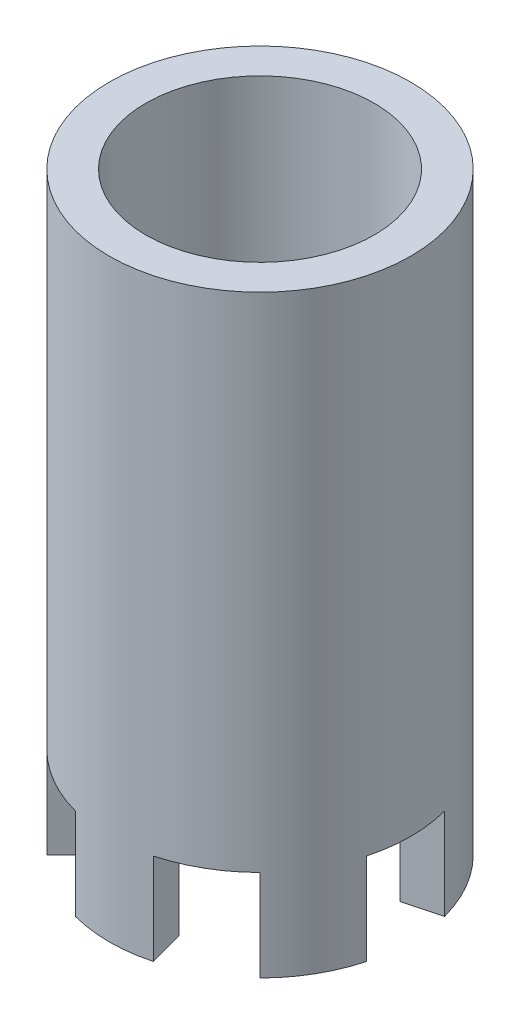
ISO-10303-21;
HEADER;
FILE_DESCRIPTION(('STEP AP214'),'2;1');
FILE_NAME('part.step','',(''),(''),'','','');
FILE_SCHEMA(('AUTOMOTIVE_DESIGN { 1 0 10303 214 1 1 1 1 }'));
ENDSEC;
DATA;
#1=APPLICATION_CONTEXT('core data for automotive mechanical design processes');
#2=APPLICATION_PROTOCOL_DEFINITION('international standard','automotive_design',2000,#1);
#3=PRODUCT_CONTEXT('',#1,'mechanical');
#4=PRODUCT('Part','Part','',(#3));
#5=PRODUCT_RELATED_PRODUCT_CATEGORY('part','',(#4));
#6=PRODUCT_DEFINITION_FORMATION('','',#4);
#7=PRODUCT_DEFINITION_CONTEXT('part definition',#1,'design');
#8=PRODUCT_DEFINITION('design','',#6,#7);
#9=PRODUCT_DEFINITION_SHAPE('','',#8);
#10=(LENGTH_UNIT() NAMED_UNIT(*) SI_UNIT(.MILLI.,.METRE.));
#11=(NAMED_UNIT(*) PLANE_ANGLE_UNIT() SI_UNIT($,.RADIAN.));
#12=(NAMED_UNIT(*) SI_UNIT($,.STERADIAN.) SOLID_ANGLE_UNIT());
#13=UNCERTAINTY_MEASURE_WITH_UNIT(LENGTH_MEASURE(1.E-05),#10,'distance_accuracy_value','');
#14=(GEOMETRIC_REPRESENTATION_CONTEXT(3) GLOBAL_UNCERTAINTY_ASSIGNED_CONTEXT((#13)) GLOBAL_UNIT_ASSIGNED_CONTEXT((#10,
#11,#12)) REPRESENTATION_CONTEXT('',''));
#15=CARTESIAN_POINT('',(0.,0.,0.));
#16=DIRECTION('',(0.,0.,1.));
#17=DIRECTION('',(1.,0.,0.));
#18=AXIS2_PLACEMENT_3D('',#15,#16,#17);
#19=CARTESIAN_POINT('',(0.,0.,0.));
#20=DIRECTION('',(0.,1.,0.));
#21=DIRECTION('',(0.,0.,1.));
#22=AXIS2_PLACEMENT_3D('',#19,#20,#21);
#23=PLANE('',#22);
#24=DIRECTION('',(-0.707106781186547,0.,0.707106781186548));
#25=VECTOR('',#24,1.);
#26=CARTESIAN_POINT('',(-1.76776695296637,0.,1.76776695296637));
#27=LINE('',#26,#25);
#28=CARTESIAN_POINT('',(-1.76776695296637,0.,1.76776695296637));
#29=VERTEX_POINT('',#28);
#30=CARTESIAN_POINT('',(-2.33345237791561,0.,2.33345237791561));
#31=VERTEX_POINT('',#30);
#32=EDGE_CURVE('E221',#29,#31,#27,.T.);
#33=ORIENTED_EDGE('',*,*,#32,.F.);
#34=CARTESIAN_POINT('',(0.,0.,0.));
#35=DIRECTION('',(0.,1.,0.));
#36=DIRECTION('',(0.,0.,1.));
#37=AXIS2_PLACEMENT_3D('',#34,#35,#36);
#38=CIRCLE('',#37,2.5);
#39=CARTESIAN_POINT('',(-0.647047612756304,0.,2.41481456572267));
#40=VERTEX_POINT('',#39);
#41=EDGE_CURVE('E206',#29,#40,#38,.T.);
#42=ORIENTED_EDGE('',*,*,#41,.T.);
#43=DIRECTION('',(0.258819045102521,0.,-0.965925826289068));
#44=VECTOR('',#43,1.);
#45=CARTESIAN_POINT('',(-0.647047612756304,0.,2.41481456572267));
#46=LINE('',#45,#44);
#47=CARTESIAN_POINT('',(-0.854102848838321,0.,3.18755522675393));
#48=VERTEX_POINT('',#47);
#49=EDGE_CURVE('E411',#48,#40,#46,.T.);
#50=ORIENTED_EDGE('',*,*,#49,.F.);
#51=CARTESIAN_POINT('',(0.,0.,0.));
#52=DIRECTION('',(0.,1.,0.));
#53=DIRECTION('',(0.,0.,1.));
#54=AXIS2_PLACEMENT_3D('',#51,#52,#53);
#55=CIRCLE('',#54,3.3);
#56=EDGE_CURVE('E59',#31,#48,#55,.T.);
#57=ORIENTED_EDGE('',*,*,#56,.F.);
#58=EDGE_LOOP('',(#33,#42,#50,#57));
#59=FACE_BOUND('',#58,.T.);
#60=ADVANCED_FACE('F43',(#59),#23,.F.);
#61=DIRECTION('',(0.965925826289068,0.,-0.25881904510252));
#62=VECTOR('',#61,1.);
#63=CARTESIAN_POINT('',(-2.41481456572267,0.,0.647047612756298));
#64=LINE('',#63,#62);
#65=CARTESIAN_POINT('',(-3.18755522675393,0.,0.854102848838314));
#66=VERTEX_POINT('',#65);
#67=CARTESIAN_POINT('',(-2.41481456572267,0.,0.647047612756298));
#68=VERTEX_POINT('',#67);
#69=EDGE_CURVE('E67',#66,#68,#64,.T.);
#70=ORIENTED_EDGE('',*,*,#69,.F.);
#71=CARTESIAN_POINT('',(-3.18755522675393,0.,-0.854102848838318));
#72=VERTEX_POINT('',#71);
#73=EDGE_CURVE('E469',#72,#66,#55,.T.);
#74=ORIENTED_EDGE('',*,*,#73,.F.);
#75=DIRECTION('',(-0.965925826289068,0.,-0.25881904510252));
#76=VECTOR('',#75,1.);
#77=CARTESIAN_POINT('',(-2.41481456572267,0.,-0.647047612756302));
#78=LINE('',#77,#76);
#79=CARTESIAN_POINT('',(-2.41481456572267,0.,-0.647047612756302));
#80=VERTEX_POINT('',#79);
#81=EDGE_CURVE('E278',#80,#72,#78,.T.);
#82=ORIENTED_EDGE('',*,*,#81,.F.);
#83=EDGE_CURVE('E217',#80,#68,#38,.T.);
#84=ORIENTED_EDGE('',*,*,#83,.T.);
#85=EDGE_LOOP('',(#70,#74,#82,#84));
#86=FACE_BOUND('',#85,.T.);
#87=ADVANCED_FACE('F457',(#86),#23,.F.);
#88=DIRECTION('',(0.707106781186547,0.,0.707106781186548));
#89=VECTOR('',#88,1.);
#90=CARTESIAN_POINT('',(-1.76776695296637,0.,-1.76776695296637));
#91=LINE('',#90,#89);
#92=CARTESIAN_POINT('',(-2.3334523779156,0.,-2.33345237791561));
#93=VERTEX_POINT('',#92);
#94=CARTESIAN_POINT('',(-1.76776695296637,0.,-1.76776695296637));
#95=VERTEX_POINT('',#94);
#96=EDGE_CURVE('E274',#93,#95,#91,.T.);
#97=ORIENTED_EDGE('',*,*,#96,.F.);
#98=CARTESIAN_POINT('',(-0.85410284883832,0.,-3.18755522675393));
#99=VERTEX_POINT('',#98);
#100=EDGE_CURVE('E473',#99,#93,#55,.T.);
#101=ORIENTED_EDGE('',*,*,#100,.F.);
#102=DIRECTION('',(-0.258819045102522,0.,-0.965925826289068));
#103=VECTOR('',#102,1.);
#104=CARTESIAN_POINT('',(-0.647047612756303,0.,-2.41481456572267));
#105=LINE('',#104,#103);
#106=CARTESIAN_POINT('',(-0.647047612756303,0.,-2.41481456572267));
#107=VERTEX_POINT('',#106);
#108=EDGE_CURVE('E315',#107,#99,#105,.T.);
#109=ORIENTED_EDGE('',*,*,#108,.F.);
#110=EDGE_CURVE('E449',#107,#95,#38,.T.);
#111=ORIENTED_EDGE('',*,*,#110,.T.);
#112=EDGE_LOOP('',(#97,#101,#109,#111));
#113=FACE_BOUND('',#112,.T.);
#114=ADVANCED_FACE('F503',(#113),#23,.F.);
#115=DIRECTION('',(-0.258819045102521,0.,0.965925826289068));
#116=VECTOR('',#115,1.);
#117=CARTESIAN_POINT('',(0.647047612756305,0.,-2.41481456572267));
#118=LINE('',#117,#116);
#119=CARTESIAN_POINT('',(0.854102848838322,0.,-3.18755522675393));
#120=VERTEX_POINT('',#119);
#121=CARTESIAN_POINT('',(0.647047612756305,0.,-2.41481456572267));
#122=VERTEX_POINT('',#121);
#123=EDGE_CURVE('E311',#120,#122,#118,.T.);
#124=ORIENTED_EDGE('',*,*,#123,.F.);
#125=CARTESIAN_POINT('',(2.33345237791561,0.,-2.33345237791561));
#126=VERTEX_POINT('',#125);
#127=EDGE_CURVE('E477',#126,#120,#55,.T.);
#128=ORIENTED_EDGE('',*,*,#127,.F.);
#129=DIRECTION('',(0.707106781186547,0.,-0.707106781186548));
#130=VECTOR('',#129,1.);
#131=CARTESIAN_POINT('',(1.76776695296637,0.,-1.76776695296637));
#132=LINE('',#131,#130);
#133=CARTESIAN_POINT('',(1.76776695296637,0.,-1.76776695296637));
#134=VERTEX_POINT('',#133);
#135=EDGE_CURVE('E352',#134,#126,#132,.T.);
#136=ORIENTED_EDGE('',*,*,#135,.F.);
#137=EDGE_CURVE('E445',#134,#122,#38,.T.);
#138=ORIENTED_EDGE('',*,*,#137,.T.);
#139=EDGE_LOOP('',(#124,#128,#136,#138));
#140=FACE_BOUND('',#139,.T.);
#141=ADVANCED_FACE('F537',(#140),#23,.F.);
#142=DIRECTION('',(-0.965925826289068,0.,0.25881904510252));
#143=VECTOR('',#142,1.);
#144=CARTESIAN_POINT('',(2.41481456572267,0.,-0.647047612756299));
#145=LINE('',#144,#143);
#146=CARTESIAN_POINT('',(3.18755522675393,0.,-0.854102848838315));
#147=VERTEX_POINT('',#146);
#148=CARTESIAN_POINT('',(2.41481456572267,0.,-0.647047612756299));
#149=VERTEX_POINT('',#148);
#150=EDGE_CURVE('E348',#147,#149,#145,.T.);
#151=ORIENTED_EDGE('',*,*,#150,.F.);
#152=CARTESIAN_POINT('',(3.18755522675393,0.,0.854102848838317));
#153=VERTEX_POINT('',#152);
#154=EDGE_CURVE('E480',#153,#147,#55,.T.);
#155=ORIENTED_EDGE('',*,*,#154,.F.);
#156=DIRECTION('',(0.965925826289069,0.,0.25881904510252));
#157=VECTOR('',#156,1.);
#158=CARTESIAN_POINT('',(2.41481456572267,0.,0.647047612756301));
#159=LINE('',#158,#157);
#160=CARTESIAN_POINT('',(2.41481456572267,0.,0.647047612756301));
#161=VERTEX_POINT('',#160);
#162=EDGE_CURVE('E389',#161,#153,#159,.T.);
#163=ORIENTED_EDGE('',*,*,#162,.F.);
#164=EDGE_CURVE('E442',#161,#149,#38,.T.);
#165=ORIENTED_EDGE('',*,*,#164,.T.);
#166=EDGE_LOOP('',(#151,#155,#163,#165));
#167=FACE_BOUND('',#166,.T.);
#168=ADVANCED_FACE('F531',(#167),#23,.F.);
#169=DIRECTION('',(-0.707106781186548,0.,-0.707106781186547));
#170=VECTOR('',#169,1.);
#171=CARTESIAN_POINT('',(1.76776695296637,0.,1.76776695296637));
#172=LINE('',#171,#170);
#173=CARTESIAN_POINT('',(2.33345237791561,0.,2.33345237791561));
#174=VERTEX_POINT('',#173);
#175=CARTESIAN_POINT('',(1.76776695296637,0.,1.76776695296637));
#176=VERTEX_POINT('',#175);
#177=EDGE_CURVE('E385',#174,#176,#172,.T.);
#178=ORIENTED_EDGE('',*,*,#177,.F.);
#179=CARTESIAN_POINT('',(0.854102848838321,0.,3.18755522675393));
#180=VERTEX_POINT('',#179);
#181=EDGE_CURVE('E47',#180,#174,#55,.T.);
#182=ORIENTED_EDGE('',*,*,#181,.F.);
#183=DIRECTION('',(0.258819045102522,0.,0.965925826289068));
#184=VECTOR('',#183,1.);
#185=CARTESIAN_POINT('',(0.647047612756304,0.,2.41481456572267));
#186=LINE('',#185,#184);
#187=CARTESIAN_POINT('',(0.647047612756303,0.,2.41481456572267));
#188=VERTEX_POINT('',#187);
#189=EDGE_CURVE('E394',#188,#180,#186,.T.);
#190=ORIENTED_EDGE('',*,*,#189,.F.);
#191=EDGE_CURVE('E220',#188,#176,#38,.T.);
#192=ORIENTED_EDGE('',*,*,#191,.T.);
#193=EDGE_LOOP('',(#178,#182,#190,#192));
#194=FACE_BOUND('',#193,.T.);
#195=ADVANCED_FACE('F523',(#194),#23,.F.);
#196=CARTESIAN_POINT('',(0.,11.,0.));
#197=DIRECTION('',(0.,1.,0.));
#198=DIRECTION('',(0.,0.,1.));
#199=AXIS2_PLACEMENT_3D('',#196,#197,#198);
#200=PLANE('',#199);
#201=CARTESIAN_POINT('',(0.,11.,0.));
#202=DIRECTION('',(0.,1.,0.));
#203=DIRECTION('',(0.,0.,1.));
#204=AXIS2_PLACEMENT_3D('',#201,#202,#203);
#205=CIRCLE('',#204,3.3);
#206=CARTESIAN_POINT('',(0.,11.,3.3));
#207=VERTEX_POINT('',#206);
#208=EDGE_CURVE('E11',#207,#207,#205,.T.);
#209=ORIENTED_EDGE('',*,*,#208,.T.);
#210=EDGE_LOOP('',(#209));
#211=FACE_BOUND('',#210,.T.);
#212=CARTESIAN_POINT('',(0.,11.,0.));
#213=DIRECTION('',(0.,1.,0.));
#214=DIRECTION('',(0.,0.,1.));
#215=AXIS2_PLACEMENT_3D('',#212,#213,#214);
#216=CIRCLE('',#215,2.5);
#217=CARTESIAN_POINT('',(0.,11.,2.5));
#218=VERTEX_POINT('',#217);
#219=EDGE_CURVE('E438',#218,#218,#216,.T.);
#220=ORIENTED_EDGE('',*,*,#219,.F.);
#221=EDGE_LOOP('',(#220));
#222=FACE_BOUND('',#221,.T.);
#223=ADVANCED_FACE('F530',(#211,#222),#200,.T.);
#224=CARTESIAN_POINT('',(0.,11.,0.));
#225=DIRECTION('',(0.,-1.,0.));
#226=DIRECTION('',(0.,0.,-1.));
#227=AXIS2_PLACEMENT_3D('',#224,#225,#226);
#228=CYLINDRICAL_SURFACE('',#227,3.3);
#229=ORIENTED_EDGE('',*,*,#208,.F.);
#230=EDGE_LOOP('',(#229));
#231=FACE_BOUND('',#230,.T.);
#232=ORIENTED_EDGE('',*,*,#181,.T.);
#233=DIRECTION('',(0.,1.,0.));
#234=VECTOR('',#233,1.);
#235=CARTESIAN_POINT('',(2.33345237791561,-2.,2.33345237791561));
#236=LINE('',#235,#234);
#237=CARTESIAN_POINT('',(2.33345237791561,-2.,2.33345237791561));
#238=VERTEX_POINT('',#237);
#239=EDGE_CURVE('E376',#238,#174,#236,.T.);
#240=ORIENTED_EDGE('',*,*,#239,.F.);
#241=CARTESIAN_POINT('',(0.,-2.,0.));
#242=DIRECTION('',(0.,-1.,0.));
#243=DIRECTION('',(0.,0.,1.));
#244=AXIS2_PLACEMENT_3D('',#241,#242,#243);
#245=CIRCLE('',#244,3.3);
#246=CARTESIAN_POINT('',(3.18755522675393,-2.,0.854102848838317));
#247=VERTEX_POINT('',#246);
#248=EDGE_CURVE('E397',#247,#238,#245,.T.);
#249=ORIENTED_EDGE('',*,*,#248,.F.);
#250=DIRECTION('',(0.,1.,0.));
#251=VECTOR('',#250,1.);
#252=CARTESIAN_POINT('',(3.18755522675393,-2.,0.854102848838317));
#253=LINE('',#252,#251);
#254=EDGE_CURVE('E372',#247,#153,#253,.T.);
#255=ORIENTED_EDGE('',*,*,#254,.T.);
#256=ORIENTED_EDGE('',*,*,#154,.T.);
#257=DIRECTION('',(0.,1.,0.));
#258=VECTOR('',#257,1.);
#259=CARTESIAN_POINT('',(3.18755522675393,-2.,-0.854102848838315));
#260=LINE('',#259,#258);
#261=CARTESIAN_POINT('',(3.18755522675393,-2.,-0.854102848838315));
#262=VERTEX_POINT('',#261);
#263=EDGE_CURVE('E339',#262,#147,#260,.T.);
#264=ORIENTED_EDGE('',*,*,#263,.F.);
#265=CARTESIAN_POINT('',(0.,-2.,0.));
#266=DIRECTION('',(0.,-1.,0.));
#267=DIRECTION('',(0.,0.,1.));
#268=AXIS2_PLACEMENT_3D('',#265,#266,#267);
#269=CIRCLE('',#268,3.3);
#270=CARTESIAN_POINT('',(2.33345237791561,-2.,-2.33345237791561));
#271=VERTEX_POINT('',#270);
#272=EDGE_CURVE('E360',#271,#262,#269,.T.);
#273=ORIENTED_EDGE('',*,*,#272,.F.);
#274=DIRECTION('',(0.,1.,0.));
#275=VECTOR('',#274,1.);
#276=CARTESIAN_POINT('',(2.33345237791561,-2.,-2.33345237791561));
#277=LINE('',#276,#275);
#278=EDGE_CURVE('E335',#271,#126,#277,.T.);
#279=ORIENTED_EDGE('',*,*,#278,.T.);
#280=ORIENTED_EDGE('',*,*,#127,.T.);
#281=DIRECTION('',(0.,1.,0.));
#282=VECTOR('',#281,1.);
#283=CARTESIAN_POINT('',(0.854102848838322,-2.,-3.18755522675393));
#284=LINE('',#283,#282);
#285=CARTESIAN_POINT('',(0.854102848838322,-2.,-3.18755522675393));
#286=VERTEX_POINT('',#285);
#287=EDGE_CURVE('E302',#286,#120,#284,.T.);
#288=ORIENTED_EDGE('',*,*,#287,.F.);
#289=CARTESIAN_POINT('',(0.,-2.,0.));
#290=DIRECTION('',(0.,-1.,0.));
#291=DIRECTION('',(0.,0.,1.));
#292=AXIS2_PLACEMENT_3D('',#289,#290,#291);
#293=CIRCLE('',#292,3.3);
#294=CARTESIAN_POINT('',(-0.85410284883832,-2.,-3.18755522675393));
#295=VERTEX_POINT('',#294);
#296=EDGE_CURVE('E323',#295,#286,#293,.T.);
#297=ORIENTED_EDGE('',*,*,#296,.F.);
#298=DIRECTION('',(0.,1.,0.));
#299=VECTOR('',#298,1.);
#300=CARTESIAN_POINT('',(-0.85410284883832,-2.,-3.18755522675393));
#301=LINE('',#300,#299);
#302=EDGE_CURVE('E298',#295,#99,#301,.T.);
#303=ORIENTED_EDGE('',*,*,#302,.T.);
#304=ORIENTED_EDGE('',*,*,#100,.T.);
#305=DIRECTION('',(0.,1.,0.));
#306=VECTOR('',#305,1.);
#307=CARTESIAN_POINT('',(-2.3334523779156,-2.,-2.33345237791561));
#308=LINE('',#307,#306);
#309=CARTESIAN_POINT('',(-2.3334523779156,-2.,-2.33345237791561));
#310=VERTEX_POINT('',#309);
#311=EDGE_CURVE('E265',#310,#93,#308,.T.);
#312=ORIENTED_EDGE('',*,*,#311,.F.);
#313=CARTESIAN_POINT('',(0.,-2.,0.));
#314=DIRECTION('',(0.,-1.,0.));
#315=DIRECTION('',(0.,0.,1.));
#316=AXIS2_PLACEMENT_3D('',#313,#314,#315);
#317=CIRCLE('',#316,3.3);
#318=CARTESIAN_POINT('',(-3.18755522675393,-2.,-0.854102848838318));
#319=VERTEX_POINT('',#318);
#320=EDGE_CURVE('E286',#319,#310,#317,.T.);
#321=ORIENTED_EDGE('',*,*,#320,.F.);
#322=DIRECTION('',(0.,1.,0.));
#323=VECTOR('',#322,1.);
#324=CARTESIAN_POINT('',(-3.18755522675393,-2.,-0.854102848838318));
#325=LINE('',#324,#323);
#326=EDGE_CURVE('E261',#319,#72,#325,.T.);
#327=ORIENTED_EDGE('',*,*,#326,.T.);
#328=ORIENTED_EDGE('',*,*,#73,.T.);
#329=DIRECTION('',(0.,1.,0.));
#330=VECTOR('',#329,1.);
#331=CARTESIAN_POINT('',(-3.18755522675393,-2.,0.854102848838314));
#332=LINE('',#331,#330);
#333=CARTESIAN_POINT('',(-3.18755522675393,-2.,0.854102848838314));
#334=VERTEX_POINT('',#333);
#335=EDGE_CURVE('E235',#334,#66,#332,.T.);
#336=ORIENTED_EDGE('',*,*,#335,.F.);
#337=CARTESIAN_POINT('',(0.,-2.,0.));
#338=DIRECTION('',(0.,-1.,0.));
#339=DIRECTION('',(0.,0.,1.));
#340=AXIS2_PLACEMENT_3D('',#337,#338,#339);
#341=CIRCLE('',#340,3.3);
#342=CARTESIAN_POINT('',(-2.33345237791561,-2.,2.33345237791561));
#343=VERTEX_POINT('',#342);
#344=EDGE_CURVE('E251',#343,#334,#341,.T.);
#345=ORIENTED_EDGE('',*,*,#344,.F.);
#346=DIRECTION('',(0.,1.,0.));
#347=VECTOR('',#346,1.);
#348=CARTESIAN_POINT('',(-2.33345237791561,-2.,2.33345237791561));
#349=LINE('',#348,#347);
#350=EDGE_CURVE('E232',#343,#31,#349,.T.);
#351=ORIENTED_EDGE('',*,*,#350,.T.);
#352=ORIENTED_EDGE('',*,*,#56,.T.);
#353=DIRECTION('',(0.,1.,0.));
#354=VECTOR('',#353,1.);
#355=CARTESIAN_POINT('',(-0.854102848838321,-2.,3.18755522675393));
#356=LINE('',#355,#354);
#357=CARTESIAN_POINT('',(-0.854102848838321,-2.,3.18755522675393));
#358=VERTEX_POINT('',#357);
#359=EDGE_CURVE('E427',#358,#48,#356,.T.);
#360=ORIENTED_EDGE('',*,*,#359,.F.);
#361=CARTESIAN_POINT('',(0.,-2.,0.));
#362=DIRECTION('',(0.,-1.,0.));
#363=DIRECTION('',(0.,0.,1.));
#364=AXIS2_PLACEMENT_3D('',#361,#362,#363);
#365=CIRCLE('',#364,3.3);
#366=CARTESIAN_POINT('',(0.854102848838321,-2.,3.18755522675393));
#367=VERTEX_POINT('',#366);
#368=EDGE_CURVE('E414',#367,#358,#365,.T.);
#369=ORIENTED_EDGE('',*,*,#368,.F.);
#370=DIRECTION('',(0.,1.,0.));
#371=VECTOR('',#370,1.);
#372=CARTESIAN_POINT('',(0.854102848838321,-2.,3.18755522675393));
#373=LINE('',#372,#371);
#374=EDGE_CURVE('E431',#367,#180,#373,.T.);
#375=ORIENTED_EDGE('',*,*,#374,.T.);
#376=EDGE_LOOP('',(#232,#240,#249,#255,#256,#264,#273,#279,#280,#288,#297,#303,#304,#312,#321,
#327,#328,#336,#345,#351,#352,#360,#369,#375));
#377=FACE_BOUND('',#376,.T.);
#378=ADVANCED_FACE('F45',(#231,#377),#228,.T.);
#379=CARTESIAN_POINT('',(0.,11.,0.));
#380=DIRECTION('',(0.,-1.,0.));
#381=DIRECTION('',(0.,0.,-1.));
#382=AXIS2_PLACEMENT_3D('',#379,#380,#381);
#383=CYLINDRICAL_SURFACE('',#382,2.5);
#384=ORIENTED_EDGE('',*,*,#219,.T.);
#385=EDGE_LOOP('',(#384));
#386=FACE_BOUND('',#385,.T.);
#387=ORIENTED_EDGE('',*,*,#191,.F.);
#388=DIRECTION('',(0.,1.,0.));
#389=VECTOR('',#388,1.);
#390=CARTESIAN_POINT('',(0.647047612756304,-2.,2.41481456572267));
#391=LINE('',#390,#389);
#392=CARTESIAN_POINT('',(0.647047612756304,-2.,2.41481456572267));
#393=VERTEX_POINT('',#392);
#394=EDGE_CURVE('E218',#393,#188,#391,.T.);
#395=ORIENTED_EDGE('',*,*,#394,.F.);
#396=CARTESIAN_POINT('',(0.,-2.,0.));
#397=DIRECTION('',(0.,1.,0.));
#398=DIRECTION('',(0.,0.,1.));
#399=AXIS2_PLACEMENT_3D('',#396,#397,#398);
#400=CIRCLE('',#399,2.5);
#401=CARTESIAN_POINT('',(-0.647047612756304,-2.,2.41481456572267));
#402=VERTEX_POINT('',#401);
#403=EDGE_CURVE('E406',#402,#393,#400,.T.);
#404=ORIENTED_EDGE('',*,*,#403,.F.);
#405=DIRECTION('',(0.,1.,0.));
#406=VECTOR('',#405,1.);
#407=CARTESIAN_POINT('',(-0.647047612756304,-2.,2.41481456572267));
#408=LINE('',#407,#406);
#409=EDGE_CURVE('E214',#402,#40,#408,.T.);
#410=ORIENTED_EDGE('',*,*,#409,.T.);
#411=ORIENTED_EDGE('',*,*,#41,.F.);
#412=DIRECTION('',(0.,1.,0.));
#413=VECTOR('',#412,1.);
#414=CARTESIAN_POINT('',(-1.76776695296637,-2.,1.76776695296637));
#415=LINE('',#414,#413);
#416=CARTESIAN_POINT('',(-1.76776695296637,-2.,1.76776695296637));
#417=VERTEX_POINT('',#416);
#418=EDGE_CURVE('E211',#417,#29,#415,.T.);
#419=ORIENTED_EDGE('',*,*,#418,.F.);
#420=CARTESIAN_POINT('',(0.,-2.,0.));
#421=DIRECTION('',(0.,1.,0.));
#422=DIRECTION('',(0.,0.,1.));
#423=AXIS2_PLACEMENT_3D('',#420,#421,#422);
#424=CIRCLE('',#423,2.5);
#425=CARTESIAN_POINT('',(-2.41481456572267,-2.,0.647047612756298));
#426=VERTEX_POINT('',#425);
#427=EDGE_CURVE('E247',#426,#417,#424,.T.);
#428=ORIENTED_EDGE('',*,*,#427,.F.);
#429=DIRECTION('',(0.,1.,0.));
#430=VECTOR('',#429,1.);
#431=CARTESIAN_POINT('',(-2.41481456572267,-2.,0.647047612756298));
#432=LINE('',#431,#430);
#433=EDGE_CURVE('E241',#426,#68,#432,.T.);
#434=ORIENTED_EDGE('',*,*,#433,.T.);
#435=ORIENTED_EDGE('',*,*,#83,.F.);
#436=DIRECTION('',(0.,1.,0.));
#437=VECTOR('',#436,1.);
#438=CARTESIAN_POINT('',(-2.41481456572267,-2.,-0.647047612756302));
#439=LINE('',#438,#437);
#440=CARTESIAN_POINT('',(-2.41481456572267,-2.,-0.647047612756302));
#441=VERTEX_POINT('',#440);
#442=EDGE_CURVE('E226',#441,#80,#439,.T.);
#443=ORIENTED_EDGE('',*,*,#442,.F.);
#444=CARTESIAN_POINT('',(0.,-2.,0.));
#445=DIRECTION('',(0.,1.,0.));
#446=DIRECTION('',(0.,0.,1.));
#447=AXIS2_PLACEMENT_3D('',#444,#445,#446);
#448=CIRCLE('',#447,2.5);
#449=CARTESIAN_POINT('',(-1.76776695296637,-2.,-1.76776695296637));
#450=VERTEX_POINT('',#449);
#451=EDGE_CURVE('E279',#450,#441,#448,.T.);
#452=ORIENTED_EDGE('',*,*,#451,.F.);
#453=DIRECTION('',(0.,1.,0.));
#454=VECTOR('',#453,1.);
#455=CARTESIAN_POINT('',(-1.76776695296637,-2.,-1.76776695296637));
#456=LINE('',#455,#454);
#457=EDGE_CURVE('E269',#450,#95,#456,.T.);
#458=ORIENTED_EDGE('',*,*,#457,.T.);
#459=ORIENTED_EDGE('',*,*,#110,.F.);
#460=DIRECTION('',(0.,1.,0.));
#461=VECTOR('',#460,1.);
#462=CARTESIAN_POINT('',(-0.647047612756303,-2.,-2.41481456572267));
#463=LINE('',#462,#461);
#464=CARTESIAN_POINT('',(-0.647047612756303,-2.,-2.41481456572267));
#465=VERTEX_POINT('',#464);
#466=EDGE_CURVE('E283',#465,#107,#463,.T.);
#467=ORIENTED_EDGE('',*,*,#466,.F.);
#468=CARTESIAN_POINT('',(0.,-2.,0.));
#469=DIRECTION('',(0.,1.,0.));
#470=DIRECTION('',(0.,0.,1.));
#471=AXIS2_PLACEMENT_3D('',#468,#469,#470);
#472=CIRCLE('',#471,2.5);
#473=CARTESIAN_POINT('',(0.647047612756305,-2.,-2.41481456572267));
#474=VERTEX_POINT('',#473);
#475=EDGE_CURVE('E316',#474,#465,#472,.T.);
#476=ORIENTED_EDGE('',*,*,#475,.F.);
#477=DIRECTION('',(0.,1.,0.));
#478=VECTOR('',#477,1.);
#479=CARTESIAN_POINT('',(0.647047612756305,-2.,-2.41481456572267));
#480=LINE('',#479,#478);
#481=EDGE_CURVE('E306',#474,#122,#480,.T.);
#482=ORIENTED_EDGE('',*,*,#481,.T.);
#483=ORIENTED_EDGE('',*,*,#137,.F.);
#484=DIRECTION('',(0.,1.,0.));
#485=VECTOR('',#484,1.);
#486=CARTESIAN_POINT('',(1.76776695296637,-2.,-1.76776695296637));
#487=LINE('',#486,#485);
#488=CARTESIAN_POINT('',(1.76776695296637,-2.,-1.76776695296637));
#489=VERTEX_POINT('',#488);
#490=EDGE_CURVE('E320',#489,#134,#487,.T.);
#491=ORIENTED_EDGE('',*,*,#490,.F.);
#492=CARTESIAN_POINT('',(0.,-2.,0.));
#493=DIRECTION('',(0.,1.,0.));
#494=DIRECTION('',(0.,0.,1.));
#495=AXIS2_PLACEMENT_3D('',#492,#493,#494);
#496=CIRCLE('',#495,2.5);
#497=CARTESIAN_POINT('',(2.41481456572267,-2.,-0.647047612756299));
#498=VERTEX_POINT('',#497);
#499=EDGE_CURVE('E353',#498,#489,#496,.T.);
#500=ORIENTED_EDGE('',*,*,#499,.F.);
#501=DIRECTION('',(0.,1.,0.));
#502=VECTOR('',#501,1.);
#503=CARTESIAN_POINT('',(2.41481456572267,-2.,-0.647047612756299));
#504=LINE('',#503,#502);
#505=EDGE_CURVE('E343',#498,#149,#504,.T.);
#506=ORIENTED_EDGE('',*,*,#505,.T.);
#507=ORIENTED_EDGE('',*,*,#164,.F.);
#508=DIRECTION('',(0.,1.,0.));
#509=VECTOR('',#508,1.);
#510=CARTESIAN_POINT('',(2.41481456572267,-2.,0.647047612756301));
#511=LINE('',#510,#509);
#512=CARTESIAN_POINT('',(2.41481456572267,-2.,0.647047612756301));
#513=VERTEX_POINT('',#512);
#514=EDGE_CURVE('E357',#513,#161,#511,.T.);
#515=ORIENTED_EDGE('',*,*,#514,.F.);
#516=CARTESIAN_POINT('',(0.,-2.,0.));
#517=DIRECTION('',(0.,1.,0.));
#518=DIRECTION('',(0.,0.,1.));
#519=AXIS2_PLACEMENT_3D('',#516,#517,#518);
#520=CIRCLE('',#519,2.5);
#521=CARTESIAN_POINT('',(1.76776695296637,-2.,1.76776695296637));
#522=VERTEX_POINT('',#521);
#523=EDGE_CURVE('E390',#522,#513,#520,.T.);
#524=ORIENTED_EDGE('',*,*,#523,.F.);
#525=DIRECTION('',(0.,1.,0.));
#526=VECTOR('',#525,1.);
#527=CARTESIAN_POINT('',(1.76776695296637,-2.,1.76776695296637));
#528=LINE('',#527,#526);
#529=EDGE_CURVE('E380',#522,#176,#528,.T.);
#530=ORIENTED_EDGE('',*,*,#529,.T.);
#531=EDGE_LOOP('',(#387,#395,#404,#410,#411,#419,#428,#434,#435,#443,#452,#458,#459,#467,#476,
#482,#483,#491,#500,#506,#507,#515,#524,#530));
#532=FACE_BOUND('',#531,.T.);
#533=ADVANCED_FACE('F208',(#386,#532),#383,.F.);
#534=CARTESIAN_POINT('',(0.647047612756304,-2.,2.41481456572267));
#535=DIRECTION('',(-0.965925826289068,0.,0.258819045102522));
#536=DIRECTION('',(0.258819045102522,0.,0.965925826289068));
#537=AXIS2_PLACEMENT_3D('',#534,#535,#536);
#538=PLANE('',#537);
#539=ORIENTED_EDGE('',*,*,#189,.T.);
#540=ORIENTED_EDGE('',*,*,#374,.F.);
#541=DIRECTION('',(0.258819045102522,0.,0.965925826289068));
#542=VECTOR('',#541,1.);
#543=CARTESIAN_POINT('',(0.647047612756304,-2.,2.41481456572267));
#544=LINE('',#543,#542);
#545=EDGE_CURVE('E410',#393,#367,#544,.T.);
#546=ORIENTED_EDGE('',*,*,#545,.F.);
#547=ORIENTED_EDGE('',*,*,#394,.T.);
#548=EDGE_LOOP('',(#539,#540,#546,#547));
#549=FACE_BOUND('',#548,.T.);
#550=ADVANCED_FACE('F614',(#549),#538,.F.);
#551=CARTESIAN_POINT('',(-0.647047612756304,-2.,2.41481456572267));
#552=DIRECTION('',(0.965925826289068,0.,0.258819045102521));
#553=DIRECTION('',(0.258819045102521,0.,-0.965925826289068));
#554=AXIS2_PLACEMENT_3D('',#551,#552,#553);
#555=PLANE('',#554);
#556=ORIENTED_EDGE('',*,*,#49,.T.);
#557=ORIENTED_EDGE('',*,*,#409,.F.);
#558=DIRECTION('',(0.258819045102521,0.,-0.965925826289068));
#559=VECTOR('',#558,1.);
#560=CARTESIAN_POINT('',(-0.647047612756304,-2.,2.41481456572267));
#561=LINE('',#560,#559);
#562=EDGE_CURVE('E417',#358,#402,#561,.T.);
#563=ORIENTED_EDGE('',*,*,#562,.F.);
#564=ORIENTED_EDGE('',*,*,#359,.T.);
#565=EDGE_LOOP('',(#556,#557,#563,#564));
#566=FACE_BOUND('',#565,.T.);
#567=ADVANCED_FACE('F640',(#566),#555,.F.);
#568=CARTESIAN_POINT('',(0.,-2.,0.));
#569=DIRECTION('',(0.,1.,0.));
#570=DIRECTION('',(0.,0.,1.));
#571=AXIS2_PLACEMENT_3D('',#568,#569,#570);
#572=PLANE('',#571);
#573=ORIENTED_EDGE('',*,*,#403,.T.);
#574=ORIENTED_EDGE('',*,*,#545,.T.);
#575=ORIENTED_EDGE('',*,*,#368,.T.);
#576=ORIENTED_EDGE('',*,*,#562,.T.);
#577=EDGE_LOOP('',(#573,#574,#575,#576));
#578=FACE_BOUND('',#577,.T.);
#579=ADVANCED_FACE('F650',(#578),#572,.F.);
#580=CARTESIAN_POINT('',(2.41481456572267,-2.,0.647047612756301));
#581=DIRECTION('',(-0.25881904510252,0.,0.965925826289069));
#582=DIRECTION('',(0.965925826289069,0.,0.25881904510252));
#583=AXIS2_PLACEMENT_3D('',#580,#581,#582);
#584=PLANE('',#583);
#585=ORIENTED_EDGE('',*,*,#162,.T.);
#586=ORIENTED_EDGE('',*,*,#254,.F.);
#587=DIRECTION('',(0.965925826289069,0.,0.25881904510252));
#588=VECTOR('',#587,1.);
#589=CARTESIAN_POINT('',(2.41481456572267,-2.,0.647047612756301));
#590=LINE('',#589,#588);
#591=EDGE_CURVE('E400',#513,#247,#590,.T.);
#592=ORIENTED_EDGE('',*,*,#591,.F.);
#593=ORIENTED_EDGE('',*,*,#514,.T.);
#594=EDGE_LOOP('',(#585,#586,#592,#593));
#595=FACE_BOUND('',#594,.T.);
#596=ADVANCED_FACE('F550',(#595),#584,.F.);
#597=CARTESIAN_POINT('',(1.76776695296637,-2.,1.76776695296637));
#598=DIRECTION('',(0.707106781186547,0.,-0.707106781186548));
#599=DIRECTION('',(-0.707106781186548,0.,-0.707106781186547));
#600=AXIS2_PLACEMENT_3D('',#597,#598,#599);
#601=PLANE('',#600);
#602=ORIENTED_EDGE('',*,*,#177,.T.);
#603=ORIENTED_EDGE('',*,*,#529,.F.);
#604=DIRECTION('',(-0.707106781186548,0.,-0.707106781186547));
#605=VECTOR('',#604,1.);
#606=CARTESIAN_POINT('',(1.76776695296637,-2.,1.76776695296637));
#607=LINE('',#606,#605);
#608=EDGE_CURVE('E384',#238,#522,#607,.T.);
#609=ORIENTED_EDGE('',*,*,#608,.F.);
#610=ORIENTED_EDGE('',*,*,#239,.T.);
#611=EDGE_LOOP('',(#602,#603,#609,#610));
#612=FACE_BOUND('',#611,.T.);
#613=ADVANCED_FACE('F540',(#612),#601,.F.);
#614=CARTESIAN_POINT('',(0.,-2.,0.));
#615=DIRECTION('',(0.,1.,0.));
#616=DIRECTION('',(0.,0.,1.));
#617=AXIS2_PLACEMENT_3D('',#614,#615,#616);
#618=PLANE('',#617);
#619=ORIENTED_EDGE('',*,*,#523,.T.);
#620=ORIENTED_EDGE('',*,*,#591,.T.);
#621=ORIENTED_EDGE('',*,*,#248,.T.);
#622=ORIENTED_EDGE('',*,*,#608,.T.);
#623=EDGE_LOOP('',(#619,#620,#621,#622));
#624=FACE_BOUND('',#623,.T.);
#625=ADVANCED_FACE('F546',(#624),#618,.F.);
#626=CARTESIAN_POINT('',(1.76776695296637,-2.,-1.76776695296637));
#627=DIRECTION('',(0.707106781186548,0.,0.707106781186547));
#628=DIRECTION('',(0.707106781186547,0.,-0.707106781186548));
#629=AXIS2_PLACEMENT_3D('',#626,#627,#628);
#630=PLANE('',#629);
#631=ORIENTED_EDGE('',*,*,#135,.T.);
#632=ORIENTED_EDGE('',*,*,#278,.F.);
#633=DIRECTION('',(0.707106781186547,0.,-0.707106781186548));
#634=VECTOR('',#633,1.);
#635=CARTESIAN_POINT('',(1.76776695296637,-2.,-1.76776695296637));
#636=LINE('',#635,#634);
#637=EDGE_CURVE('E363',#489,#271,#636,.T.);
#638=ORIENTED_EDGE('',*,*,#637,.F.);
#639=ORIENTED_EDGE('',*,*,#490,.T.);
#640=EDGE_LOOP('',(#631,#632,#638,#639));
#641=FACE_BOUND('',#640,.T.);
#642=ADVANCED_FACE('F560',(#641),#630,.F.);
#643=CARTESIAN_POINT('',(2.41481456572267,-2.,-0.647047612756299));
#644=DIRECTION('',(-0.25881904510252,0.,-0.965925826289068));
#645=DIRECTION('',(-0.965925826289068,0.,0.25881904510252));
#646=AXIS2_PLACEMENT_3D('',#643,#644,#645);
#647=PLANE('',#646);
#648=ORIENTED_EDGE('',*,*,#150,.T.);
#649=ORIENTED_EDGE('',*,*,#505,.F.);
#650=DIRECTION('',(-0.965925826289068,0.,0.25881904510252));
#651=VECTOR('',#650,1.);
#652=CARTESIAN_POINT('',(2.41481456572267,-2.,-0.647047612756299));
#653=LINE('',#652,#651);
#654=EDGE_CURVE('E347',#262,#498,#653,.T.);
#655=ORIENTED_EDGE('',*,*,#654,.F.);
#656=ORIENTED_EDGE('',*,*,#263,.T.);
#657=EDGE_LOOP('',(#648,#649,#655,#656));
#658=FACE_BOUND('',#657,.T.);
#659=ADVANCED_FACE('F553',(#658),#647,.F.);
#660=CARTESIAN_POINT('',(0.,-2.,0.));
#661=DIRECTION('',(0.,1.,0.));
#662=DIRECTION('',(0.,0.,1.));
#663=AXIS2_PLACEMENT_3D('',#660,#661,#662);
#664=PLANE('',#663);
#665=ORIENTED_EDGE('',*,*,#499,.T.);
#666=ORIENTED_EDGE('',*,*,#637,.T.);
#667=ORIENTED_EDGE('',*,*,#272,.T.);
#668=ORIENTED_EDGE('',*,*,#654,.T.);
#669=EDGE_LOOP('',(#665,#666,#667,#668));
#670=FACE_BOUND('',#669,.T.);
#671=ADVANCED_FACE('F558',(#670),#664,.F.);
#672=CARTESIAN_POINT('',(-0.647047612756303,-2.,-2.41481456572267));
#673=DIRECTION('',(0.965925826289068,0.,-0.258819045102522));
#674=DIRECTION('',(-0.258819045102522,0.,-0.965925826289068));
#675=AXIS2_PLACEMENT_3D('',#672,#673,#674);
#676=PLANE('',#675);
#677=ORIENTED_EDGE('',*,*,#108,.T.);
#678=ORIENTED_EDGE('',*,*,#302,.F.);
#679=DIRECTION('',(-0.258819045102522,0.,-0.965925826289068));
#680=VECTOR('',#679,1.);
#681=CARTESIAN_POINT('',(-0.647047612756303,-2.,-2.41481456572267));
#682=LINE('',#681,#680);
#683=EDGE_CURVE('E326',#465,#295,#682,.T.);
#684=ORIENTED_EDGE('',*,*,#683,.F.);
#685=ORIENTED_EDGE('',*,*,#466,.T.);
#686=EDGE_LOOP('',(#677,#678,#684,#685));
#687=FACE_BOUND('',#686,.T.);
#688=ADVANCED_FACE('F502',(#687),#676,.F.);
#689=CARTESIAN_POINT('',(0.647047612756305,-2.,-2.41481456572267));
#690=DIRECTION('',(-0.965925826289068,0.,-0.258819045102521));
#691=DIRECTION('',(-0.258819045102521,0.,0.965925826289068));
#692=AXIS2_PLACEMENT_3D('',#689,#690,#691);
#693=PLANE('',#692);
#694=ORIENTED_EDGE('',*,*,#123,.T.);
#695=ORIENTED_EDGE('',*,*,#481,.F.);
#696=DIRECTION('',(-0.258819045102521,0.,0.965925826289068));
#697=VECTOR('',#696,1.);
#698=CARTESIAN_POINT('',(0.647047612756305,-2.,-2.41481456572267));
#699=LINE('',#698,#697);
#700=EDGE_CURVE('E310',#286,#474,#699,.T.);
#701=ORIENTED_EDGE('',*,*,#700,.F.);
#702=ORIENTED_EDGE('',*,*,#287,.T.);
#703=EDGE_LOOP('',(#694,#695,#701,#702));
#704=FACE_BOUND('',#703,.T.);
#705=ADVANCED_FACE('F493',(#704),#693,.F.);
#706=CARTESIAN_POINT('',(0.,-2.,0.));
#707=DIRECTION('',(0.,1.,0.));
#708=DIRECTION('',(0.,0.,1.));
#709=AXIS2_PLACEMENT_3D('',#706,#707,#708);
#710=PLANE('',#709);
#711=ORIENTED_EDGE('',*,*,#475,.T.);
#712=ORIENTED_EDGE('',*,*,#683,.T.);
#713=ORIENTED_EDGE('',*,*,#296,.T.);
#714=ORIENTED_EDGE('',*,*,#700,.T.);
#715=EDGE_LOOP('',(#711,#712,#713,#714));
#716=FACE_BOUND('',#715,.T.);
#717=ADVANCED_FACE('F497',(#716),#710,.F.);
#718=CARTESIAN_POINT('',(-2.41481456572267,-2.,-0.647047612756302));
#719=DIRECTION('',(0.25881904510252,0.,-0.965925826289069));
#720=DIRECTION('',(-0.965925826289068,0.,-0.25881904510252));
#721=AXIS2_PLACEMENT_3D('',#718,#719,#720);
#722=PLANE('',#721);
#723=ORIENTED_EDGE('',*,*,#81,.T.);
#724=ORIENTED_EDGE('',*,*,#326,.F.);
#725=DIRECTION('',(-0.965925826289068,0.,-0.25881904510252));
#726=VECTOR('',#725,1.);
#727=CARTESIAN_POINT('',(-2.41481456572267,-2.,-0.647047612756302));
#728=LINE('',#727,#726);
#729=EDGE_CURVE('E289',#441,#319,#728,.T.);
#730=ORIENTED_EDGE('',*,*,#729,.F.);
#731=ORIENTED_EDGE('',*,*,#442,.T.);
#732=EDGE_LOOP('',(#723,#724,#730,#731));
#733=FACE_BOUND('',#732,.T.);
#734=ADVANCED_FACE('F512',(#733),#722,.F.);
#735=CARTESIAN_POINT('',(-1.76776695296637,-2.,-1.76776695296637));
#736=DIRECTION('',(-0.707106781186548,0.,0.707106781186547));
#737=DIRECTION('',(0.707106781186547,0.,0.707106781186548));
#738=AXIS2_PLACEMENT_3D('',#735,#736,#737);
#739=PLANE('',#738);
#740=ORIENTED_EDGE('',*,*,#96,.T.);
#741=ORIENTED_EDGE('',*,*,#457,.F.);
#742=DIRECTION('',(0.707106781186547,0.,0.707106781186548));
#743=VECTOR('',#742,1.);
#744=CARTESIAN_POINT('',(-1.76776695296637,-2.,-1.76776695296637));
#745=LINE('',#744,#743);
#746=EDGE_CURVE('E273',#310,#450,#745,.T.);
#747=ORIENTED_EDGE('',*,*,#746,.F.);
#748=ORIENTED_EDGE('',*,*,#311,.T.);
#749=EDGE_LOOP('',(#740,#741,#747,#748));
#750=FACE_BOUND('',#749,.T.);
#751=ADVANCED_FACE('F506',(#750),#739,.F.);
#752=CARTESIAN_POINT('',(0.,-2.,0.));
#753=DIRECTION('',(0.,1.,0.));
#754=DIRECTION('',(0.,0.,1.));
#755=AXIS2_PLACEMENT_3D('',#752,#753,#754);
#756=PLANE('',#755);
#757=ORIENTED_EDGE('',*,*,#451,.T.);
#758=ORIENTED_EDGE('',*,*,#729,.T.);
#759=ORIENTED_EDGE('',*,*,#320,.T.);
#760=ORIENTED_EDGE('',*,*,#746,.T.);
#761=EDGE_LOOP('',(#757,#758,#759,#760));
#762=FACE_BOUND('',#761,.T.);
#763=ADVANCED_FACE('F510',(#762),#756,.F.);
#764=CARTESIAN_POINT('',(-1.76776695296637,-2.,1.76776695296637));
#765=DIRECTION('',(-0.707106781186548,0.,-0.707106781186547));
#766=DIRECTION('',(-0.707106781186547,0.,0.707106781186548));
#767=AXIS2_PLACEMENT_3D('',#764,#765,#766);
#768=PLANE('',#767);
#769=ORIENTED_EDGE('',*,*,#32,.T.);
#770=ORIENTED_EDGE('',*,*,#350,.F.);
#771=DIRECTION('',(-0.707106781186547,0.,0.707106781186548));
#772=VECTOR('',#771,1.);
#773=CARTESIAN_POINT('',(-1.76776695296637,-2.,1.76776695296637));
#774=LINE('',#773,#772);
#775=EDGE_CURVE('E229',#417,#343,#774,.T.);
#776=ORIENTED_EDGE('',*,*,#775,.F.);
#777=ORIENTED_EDGE('',*,*,#418,.T.);
#778=EDGE_LOOP('',(#769,#770,#776,#777));
#779=FACE_BOUND('',#778,.T.);
#780=ADVANCED_FACE('F228',(#779),#768,.F.);
#781=CARTESIAN_POINT('',(-2.41481456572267,-2.,0.647047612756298));
#782=DIRECTION('',(0.25881904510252,0.,0.965925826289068));
#783=DIRECTION('',(0.965925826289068,0.,-0.25881904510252));
#784=AXIS2_PLACEMENT_3D('',#781,#782,#783);
#785=PLANE('',#784);
#786=ORIENTED_EDGE('',*,*,#69,.T.);
#787=ORIENTED_EDGE('',*,*,#433,.F.);
#788=DIRECTION('',(0.965925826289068,0.,-0.25881904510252));
#789=VECTOR('',#788,1.);
#790=CARTESIAN_POINT('',(-2.41481456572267,-2.,0.647047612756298));
#791=LINE('',#790,#789);
#792=EDGE_CURVE('E245',#334,#426,#791,.T.);
#793=ORIENTED_EDGE('',*,*,#792,.F.);
#794=ORIENTED_EDGE('',*,*,#335,.T.);
#795=EDGE_LOOP('',(#786,#787,#793,#794));
#796=FACE_BOUND('',#795,.T.);
#797=ADVANCED_FACE('F461',(#796),#785,.F.);
#798=CARTESIAN_POINT('',(0.,-2.,0.));
#799=DIRECTION('',(0.,1.,0.));
#800=DIRECTION('',(0.,0.,1.));
#801=AXIS2_PLACEMENT_3D('',#798,#799,#800);
#802=PLANE('',#801);
#803=ORIENTED_EDGE('',*,*,#427,.T.);
#804=ORIENTED_EDGE('',*,*,#775,.T.);
#805=ORIENTED_EDGE('',*,*,#344,.T.);
#806=ORIENTED_EDGE('',*,*,#792,.T.);
#807=EDGE_LOOP('',(#803,#804,#805,#806));
#808=FACE_BOUND('',#807,.T.);
#809=ADVANCED_FACE('F465',(#808),#802,.F.);
#810=CLOSED_SHELL('',(#60,#87,#114,#141,#168,#195,#223,#378,#533,#550,#567,#579,#596,#613,#625,
#642,#659,#671,#688,#705,#717,#734,#751,#763,#780,#797,#809));
#811=MANIFOLD_SOLID_BREP('B2',#810);
#812=ADVANCED_BREP_SHAPE_REPRESENTATION('',(#18,#811),#14);
#813=SHAPE_DEFINITION_REPRESENTATION(#9,#812);
ENDSEC;
END-ISO-10303-21;
